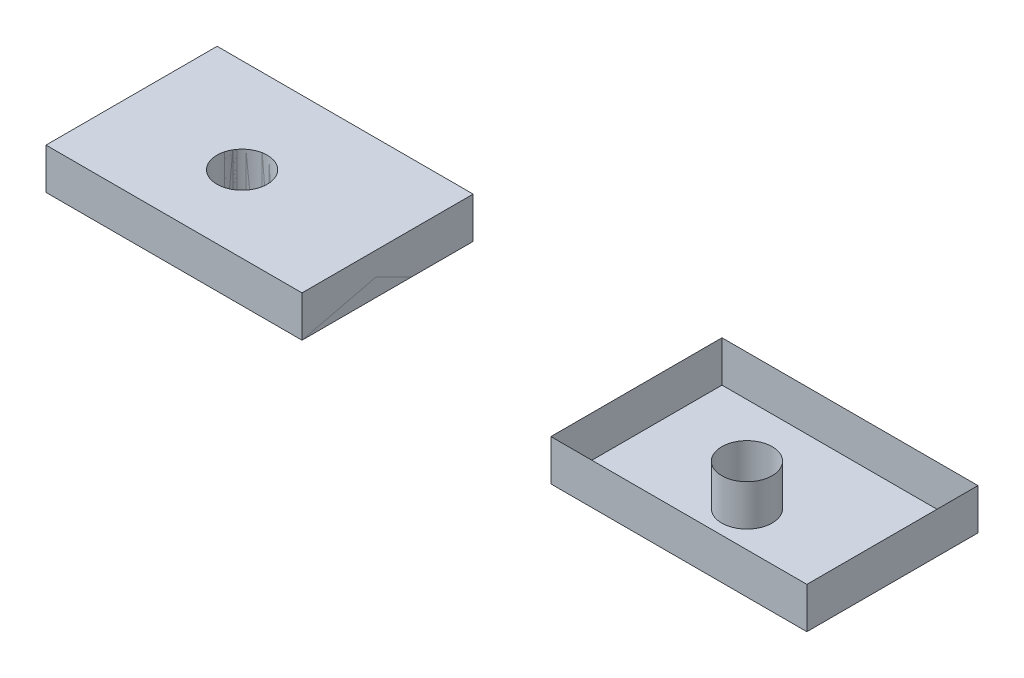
from build123d import *

# Parameters (mm, degrees)
SKETCH2_W          = 129.589842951
SKETCH2_H          = 86.625549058
EXTRUDE1_DEPTH     = 20.76720579
SKETCH3_R          = 12.758058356
CUT_EXTRUDE1_DEPTH = 317.65332187


with BuildPart() as part:
    # Sketch2 → Extrude1 (new body)
    with BuildSketch(Plane(origin=(0, 0, 0), x_dir=(1, 0, 0), z_dir=(0, 1, 0))):
        with Locations((239.070284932, 43.312774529)):
            Rectangle(SKETCH2_W, SKETCH2_H)
    extrude(amount=EXTRUDE1_DEPTH)

    # Sketch3 → Cut-Extrude1 (cut, through all)
    with BuildSketch(Plane(origin=(0, 20.76720579, 0), x_dir=(-1, 0, 0), z_dir=(0, 1, 0))):
        with Locations(Location((-234.699108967, -38.835495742, 0), (0, 0, 90))):
            Circle(SKETCH3_R)
    extrude(amount=-CUT_EXTRUDE1_DEPTH, mode=Mode.SUBTRACT)


solid = part.part
